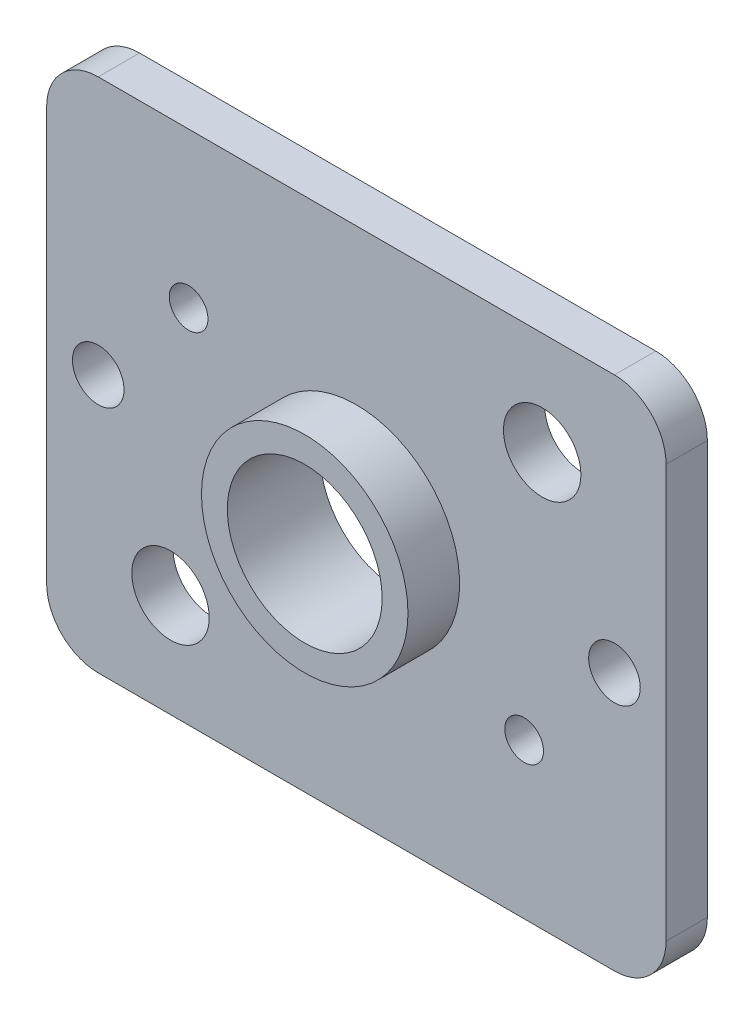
from build123d import *

# Parameters (mm, degrees)
SKETCH_1_W          = 12
SKETCH_1_H          = 10
EXTRUDE_1_DEPTH     = 0.8
CUT_EXTRUDE_1_REACH = 9.851
SKETCH_2_R          = 1.5
SKETCH_2_R_2        = 0.75
SKETCH_2_R_3        = 0.375
FILLET_1_R          = 1
SKETCH_5_R          = 0.5
CUT_EXTRUDE_2_DEPTH = 8.851114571
EXTRUDE_START       = 1
SKETCH_14_R         = 2
SKETCH_14_R_2       = 1.5
EXTRUDE_2_DEPTH     = 1


with BuildPart() as part:
    # Sketch 1 → Extrude 1 (new body)
    with BuildSketch(Plane.XY):
        Rectangle(SKETCH_1_W, SKETCH_1_H)
    extrude(amount=EXTRUDE_1_DEPTH)

    # Sketch 2 → Cut-Extrude 1 (cut, up to next)
    with BuildSketch(Plane.XY.offset(0.8), mode=Mode.PRIVATE) as cut_extrude_1_sk1:
        Circle(SKETCH_2_R)
    cut_extrude_1_tool1 = extrude(cut_extrude_1_sk1.sketch, amount=-CUT_EXTRUDE_1_REACH, mode=Mode.PRIVATE) & part.part
    # Sketch 2 → Cut-Extrude 1 (cut, up to next)
    with BuildSketch(Plane.XY.offset(0.8), mode=Mode.PRIVATE) as cut_extrude_1_sk2:
        with Locations((-3.6, -3)):
            Circle(SKETCH_2_R_2)
    cut_extrude_1_tool2 = extrude(cut_extrude_1_sk2.sketch, amount=-CUT_EXTRUDE_1_REACH, mode=Mode.PRIVATE) & part.part
    # Sketch 2 → Cut-Extrude 1 (cut, up to next)
    with BuildSketch(Plane.XY.offset(0.8), mode=Mode.PRIVATE) as cut_extrude_1_sk3:
        with Locations((3.6, 3)):
            Circle(SKETCH_2_R_2)
    cut_extrude_1_tool3 = extrude(cut_extrude_1_sk3.sketch, amount=-CUT_EXTRUDE_1_REACH, mode=Mode.PRIVATE) & part.part
    # Sketch 2 → Cut-Extrude 1 (cut, up to next)
    with BuildSketch(Plane.XY.offset(0.8), mode=Mode.PRIVATE) as cut_extrude_1_sk4:
        with Locations((3.25, -2)):
            Circle(SKETCH_2_R_3)
    cut_extrude_1_tool4 = extrude(cut_extrude_1_sk4.sketch, amount=-CUT_EXTRUDE_1_REACH, mode=Mode.PRIVATE) & part.part
    # Sketch 2 → Cut-Extrude 1 (cut, up to next)
    with BuildSketch(Plane.XY.offset(0.8), mode=Mode.PRIVATE) as cut_extrude_1_sk5:
        with Locations((-3.25, 2)):
            Circle(SKETCH_2_R_3)
    cut_extrude_1_tool5 = extrude(cut_extrude_1_sk5.sketch, amount=-CUT_EXTRUDE_1_REACH, mode=Mode.PRIVATE) & part.part
    add(cut_extrude_1_tool1.solids().sort_by_distance((0, 0, 0.8))[0], mode=Mode.SUBTRACT)
    add(cut_extrude_1_tool2.solids().sort_by_distance((-3.6, -3, 0.8))[0], mode=Mode.SUBTRACT)
    add(cut_extrude_1_tool3.solids().sort_by_distance((3.6, 3, 0.8))[0], mode=Mode.SUBTRACT)
    add(cut_extrude_1_tool4.solids().sort_by_distance((3.25, -2, 0.8))[0], mode=Mode.SUBTRACT)
    add(cut_extrude_1_tool5.solids().sort_by_distance((-3.25, 2, 0.8))[0], mode=Mode.SUBTRACT)

    # Fillet 1
    fillet_1_edges = [part.edges().sort_by_distance(p)[0] for p in [
        (6, -5, 0.4),
        (-6, -5, 0.4),
        (-6, 5, 0.4),
        (6, 5, 0.4),
    ]]
    fillet(fillet_1_edges, radius=FILLET_1_R)

    # Sketch 5 → Cut-Extrude 2 (cut, through all)
    with BuildSketch(Plane.XY.offset(0.8)):
        with Locations((5, 0)):
            Circle(SKETCH_5_R)
        with Locations((-5, 0)):
            Circle(SKETCH_5_R)
    extrude(amount=-CUT_EXTRUDE_2_DEPTH, mode=Mode.SUBTRACT)

    # Sketch 14 → Extrude 2 (add)
    with BuildSketch(Plane.XY.offset(0.8).offset(EXTRUDE_START)):
        with Locations(Location((0, 0, 0), (0, 0, 180))):
            Circle(SKETCH_14_R)
        Circle(SKETCH_14_R_2, mode=Mode.SUBTRACT)
    extrude(amount=-EXTRUDE_2_DEPTH)


solid = part.part
